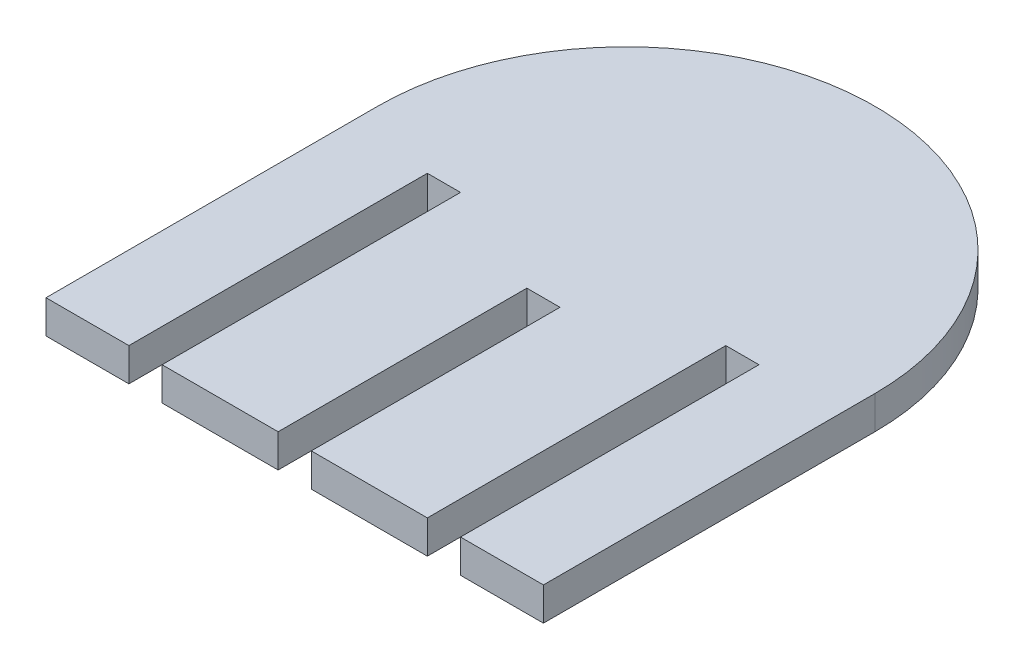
from build123d import *

# Parameters (mm, degrees)
BOSS_EXTRUDE1_DEPTH = 2
SKETCH3_W           = 2
SKETCH3_H           = 2
CUT_EXTRUDE1_DEPTH  = 18
SKETCH4_W           = 2
SKETCH4_H           = 2
CUT_EXTRUDE2_DEPTH  = 15


with BuildPart() as part:
    # Sketch1 → Boss-Extrude1 (new body)
    with BuildSketch(Plane(origin=(0, 0, 0), x_dir=(1, 0, 0), z_dir=(0, 1, 0))):
        with BuildLine():
            Line((-15, 0), (15, 0))
            Line((15, 0), (15, 20))
            ThreePointArc((15, 20), (0, 35), (-15, 20))
            Line((-15, 20), (-15, 0))
        make_face()
    extrude(amount=BOSS_EXTRUDE1_DEPTH)

    # Sketch3 → Cut-Extrude1 (cut)
    with BuildSketch(Plane.XY):
        with Locations((9, 1)):
            Rectangle(SKETCH3_W, SKETCH3_H)
        with Locations((-9, 1)):
            Rectangle(SKETCH3_W, SKETCH3_H)
    extrude(amount=-CUT_EXTRUDE1_DEPTH, mode=Mode.SUBTRACT)

    # Sketch4 → Cut-Extrude2 (cut)
    with BuildSketch(Plane.XY):
        with Locations((0, 1)):
            Rectangle(SKETCH4_W, SKETCH4_H)
    extrude(amount=-CUT_EXTRUDE2_DEPTH, mode=Mode.SUBTRACT)


solid = part.part
